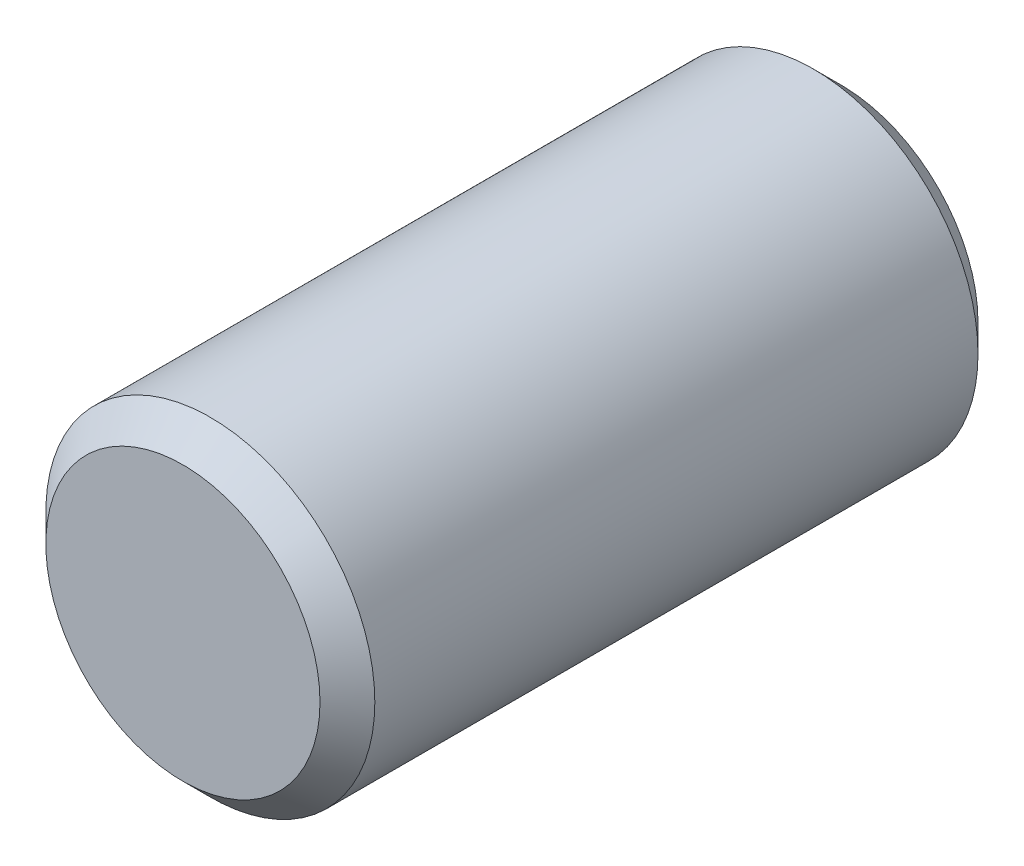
from build123d import *


with BuildPart() as part:
    # Sketch1 → Revolve1 (revolve)
    with BuildSketch(Plane(origin=(0, 0, 0), x_dir=(0, 0, -1), z_dir=(1, 0, 0)), mode=Mode.PRIVATE) as revolve1_sk:
        Polygon((0, 0), (6, 0), (6, 1.249986), (5.749986, 1.5), (0.250014, 1.5), (0, 1.249986), align=None)
    revolve(revolve1_sk.sketch.rotate(Axis((0, 0, -10.674691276), (0, 0, -1)), 90), axis=Axis((0, 0, -10.674691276), (0, 0, -1)))


solid = part.part
